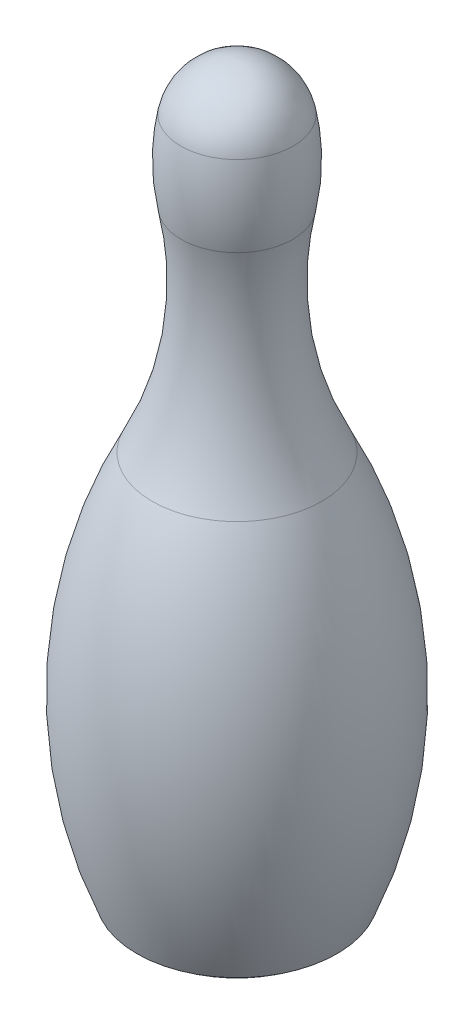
ISO-10303-21;
HEADER;
FILE_DESCRIPTION(('STEP AP214'),'2;1');
FILE_NAME('part.step','',(''),(''),'','','');
FILE_SCHEMA(('AUTOMOTIVE_DESIGN { 1 0 10303 214 1 1 1 1 }'));
ENDSEC;
DATA;
#1=APPLICATION_CONTEXT('core data for automotive mechanical design processes');
#2=APPLICATION_PROTOCOL_DEFINITION('international standard','automotive_design',2000,#1);
#3=PRODUCT_CONTEXT('',#1,'mechanical');
#4=PRODUCT('Part','Part','',(#3));
#5=PRODUCT_RELATED_PRODUCT_CATEGORY('part','',(#4));
#6=PRODUCT_DEFINITION_FORMATION('','',#4);
#7=PRODUCT_DEFINITION_CONTEXT('part definition',#1,'design');
#8=PRODUCT_DEFINITION('design','',#6,#7);
#9=PRODUCT_DEFINITION_SHAPE('','',#8);
#10=(LENGTH_UNIT() NAMED_UNIT(*) SI_UNIT(.MILLI.,.METRE.));
#11=(NAMED_UNIT(*) PLANE_ANGLE_UNIT() SI_UNIT($,.RADIAN.));
#12=(NAMED_UNIT(*) SI_UNIT($,.STERADIAN.) SOLID_ANGLE_UNIT());
#13=UNCERTAINTY_MEASURE_WITH_UNIT(LENGTH_MEASURE(1.E-05),#10,'distance_accuracy_value','');
#14=(GEOMETRIC_REPRESENTATION_CONTEXT(3) GLOBAL_UNCERTAINTY_ASSIGNED_CONTEXT((#13)) GLOBAL_UNIT_ASSIGNED_CONTEXT((#10,
#11,#12)) REPRESENTATION_CONTEXT('',''));
#15=CARTESIAN_POINT('',(0.,0.,0.));
#16=DIRECTION('',(0.,0.,1.));
#17=DIRECTION('',(1.,0.,0.));
#18=AXIS2_PLACEMENT_3D('',#15,#16,#17);
#19=CARTESIAN_POINT('',(0.,0.,0.));
#20=DIRECTION('',(0.,-1.,0.));
#21=DIRECTION('',(0.,0.,-1.));
#22=AXIS2_PLACEMENT_3D('',#19,#20,#21);
#23=PLANE('',#22);
#24=CARTESIAN_POINT('',(0.,0.,0.));
#25=DIRECTION('',(0.,-1.,0.));
#26=DIRECTION('',(0.,0.,-1.));
#27=AXIS2_PLACEMENT_3D('',#24,#25,#26);
#28=CIRCLE('',#27,4.57848572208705);
#29=CARTESIAN_POINT('',(0.,0.,-4.57848572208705));
#30=VERTEX_POINT('',#29);
#31=EDGE_CURVE('E44',#30,#30,#28,.T.);
#32=ORIENTED_EDGE('',*,*,#31,.T.);
#33=EDGE_LOOP('',(#32));
#34=FACE_BOUND('',#33,.T.);
#35=ADVANCED_FACE('F36',(#34),#23,.T.);
#36=CARTESIAN_POINT('',(0.,9.56398818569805,0.));
#37=DIRECTION('',(0.,-1.,0.));
#38=DIRECTION('',(0.,0.,-1.));
#39=AXIS2_PLACEMENT_3D('',#36,#37,#38);
#40=DEGENERATE_TOROIDAL_SURFACE('',#39,16.8674675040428,23.8674675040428,.F.);
#41=CARTESIAN_POINT('',(0.,0.452104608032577,0.));
#42=DIRECTION('',(0.,1.,0.));
#43=DIRECTION('',(0.,0.,1.));
#44=AXIS2_PLACEMENT_3D('',#41,#42,#43);
#45=CIRCLE('',#44,5.19221478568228);
#46=CARTESIAN_POINT('',(0.,0.452104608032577,5.19221478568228));
#47=VERTEX_POINT('',#46);
#48=EDGE_CURVE('E10',#47,#47,#45,.T.);
#49=ORIENTED_EDGE('',*,*,#48,.T.);
#50=EDGE_LOOP('',(#49));
#51=FACE_BOUND('',#50,.T.);
#52=CARTESIAN_POINT('',(0.,20.3888848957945,0.));
#53=DIRECTION('',(0.,-1.,0.));
#54=DIRECTION('',(0.,0.,-1.));
#55=AXIS2_PLACEMENT_3D('',#52,#53,#54);
#56=CIRCLE('',#55,4.40405374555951);
#57=CARTESIAN_POINT('',(0.,20.3888848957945,-4.40405374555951));
#58=VERTEX_POINT('',#57);
#59=EDGE_CURVE('E48',#58,#58,#56,.T.);
#60=ORIENTED_EDGE('',*,*,#59,.T.);
#61=EDGE_LOOP('',(#60));
#62=FACE_BOUND('',#61,.T.);
#63=ADVANCED_FACE('F75',(#51,#62),#40,.F.);
#64=CARTESIAN_POINT('',(0.,28.0670466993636,0.));
#65=DIRECTION('',(0.,-1.,0.));
#66=DIRECTION('',(0.,0.,-1.));
#67=AXIS2_PLACEMENT_3D('',#64,#65,#66);
#68=TOROIDAL_SURFACE('',#67,19.4920667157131,16.9293326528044);
#69=CARTESIAN_POINT('',(0.,31.4059064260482,0.));
#70=DIRECTION('',(0.,-1.,0.));
#71=DIRECTION('',(0.,0.,-1.));
#72=AXIS2_PLACEMENT_3D('',#69,#70,#71);
#73=CIRCLE('',#72,2.89525015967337);
#74=CARTESIAN_POINT('',(0.,31.4059064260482,-2.89525015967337));
#75=VERTEX_POINT('',#74);
#76=EDGE_CURVE('E52',#75,#75,#73,.T.);
#77=ORIENTED_EDGE('',*,*,#76,.T.);
#78=EDGE_LOOP('',(#77));
#79=FACE_BOUND('',#78,.T.);
#80=ORIENTED_EDGE('',*,*,#59,.F.);
#81=EDGE_LOOP('',(#80));
#82=FACE_BOUND('',#81,.T.);
#83=ADVANCED_FACE('F72',(#79,#82),#68,.F.);
#84=CARTESIAN_POINT('',(0.,33.5382802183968,0.));
#85=DIRECTION('',(0.,-1.,0.));
#86=DIRECTION('',(0.,0.,-1.));
#87=AXIS2_PLACEMENT_3D('',#84,#85,#86);
#88=DEGENERATE_TOROIDAL_SURFACE('',#87,7.7043615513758,10.8119742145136,.F.);
#89=CARTESIAN_POINT('',(0.,35.6025015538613,0.));
#90=DIRECTION('',(0.,-1.,0.));
#91=DIRECTION('',(0.,0.,-1.));
#92=AXIS2_PLACEMENT_3D('',#89,#90,#91);
#93=CIRCLE('',#92,2.90873303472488);
#94=CARTESIAN_POINT('',(0.,35.6025015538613,-2.90873303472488));
#95=VERTEX_POINT('',#94);
#96=EDGE_CURVE('E57',#95,#95,#93,.T.);
#97=ORIENTED_EDGE('',*,*,#96,.T.);
#98=EDGE_LOOP('',(#97));
#99=FACE_BOUND('',#98,.T.);
#100=ORIENTED_EDGE('',*,*,#76,.F.);
#101=EDGE_LOOP('',(#100));
#102=FACE_BOUND('',#101,.T.);
#103=ADVANCED_FACE('F61',(#99,#102),#88,.F.);
#104=CARTESIAN_POINT('',(0.,35.0367599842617,0.));
#105=DIRECTION('',(0.,-1.,0.));
#106=DIRECTION('',(1.,0.,0.));
#107=AXIS2_PLACEMENT_3D('',#104,#105,#106);
#108=SPHERICAL_SURFACE('',#107,2.96324001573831);
#109=ORIENTED_EDGE('',*,*,#96,.F.);
#110=EDGE_LOOP('',(#109));
#111=FACE_BOUND('',#110,.T.);
#112=ADVANCED_FACE('F64',(#111),#108,.T.);
#113=CARTESIAN_POINT('',(0.,0.,0.));
#114=DIRECTION('',(0.,1.,0.));
#115=DIRECTION('',(0.,0.,1.));
#116=AXIS2_PLACEMENT_3D('',#113,#114,#115);
#117=CONICAL_SURFACE('',#116,4.57848572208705,0.935892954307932);
#118=ORIENTED_EDGE('',*,*,#48,.F.);
#119=EDGE_LOOP('',(#118));
#120=FACE_BOUND('',#119,.T.);
#121=ORIENTED_EDGE('',*,*,#31,.F.);
#122=EDGE_LOOP('',(#121));
#123=FACE_BOUND('',#122,.T.);
#124=ADVANCED_FACE('F39',(#120,#123),#117,.T.);
#125=CLOSED_SHELL('',(#35,#63,#83,#103,#112,#124));
#126=MANIFOLD_SOLID_BREP('B2',#125);
#127=ADVANCED_BREP_SHAPE_REPRESENTATION('',(#18,#126),#14);
#128=SHAPE_DEFINITION_REPRESENTATION(#9,#127);
ENDSEC;
END-ISO-10303-21;
